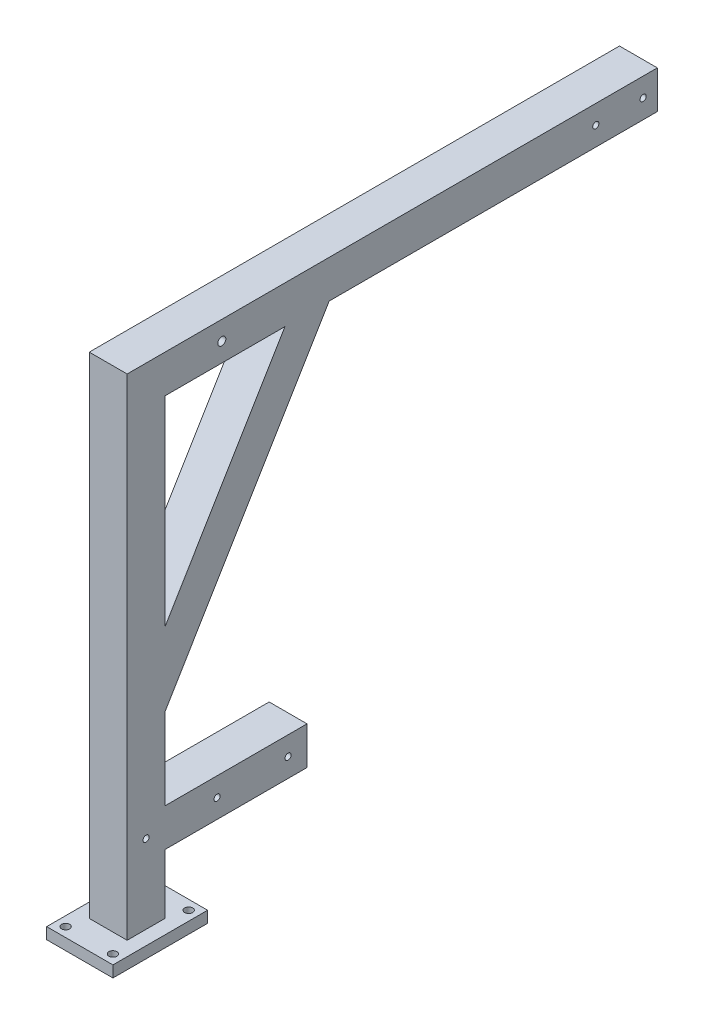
from build123d import *

# Parameters (mm, degrees)
EXTRUDE_1_DEPTH      = 590
SKETCH_4_OUTSIDE_W   = 231.236
SKETCH_4_OUTSIDE_H   = 751.236
SKETCH_4_OUTSIDE_R   = 4.25
CUT_EXTRUDE_1_DEPTH  = 797.178371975
SKETCH_5_OUTSIDE_W   = 751.236
SKETCH_5_OUTSIDE_H   = 691.236
SKETCH_5_OUTSIDE_R   = 3.25
SKETCH_5_OUTSIDE_R_2 = 4.25
CUT_EXTRUDE_2_DEPTH  = 590


with BuildPart() as part:
    # Sketch 2 → Extrude 1 (new body)
    with BuildSketch(Plane.XY):
        Polygon((55, 12), (55, 490), (55, 530), (15, 530), (15, 490), (15, 12), (0, 12), (0, 0), (70, 0), (70, 12), align=None)
    extrude(amount=EXTRUDE_1_DEPTH)

    # Sketch 4 outside → Cut-Extrude 1 (cut, through all)
    # profile 1 of 5: a face of its own
    with BuildSketch(Plane(origin=(0, 530, 0), x_dir=(1, 0, 0), z_dir=(0, 1, 0))):
        with Locations((35, -295)):
            Rectangle(SKETCH_4_OUTSIDE_W, SKETCH_4_OUTSIDE_H)
        Polygon((70, -490), (70, -590), (0, -590), (0, -490), (15, -490), (15, 0), (55, 0), (55, -490), align=None, mode=Mode.SUBTRACT)
    # profile 2 of 5: a face of its own
    with BuildSketch(Plane(origin=(0, 530, 0), x_dir=(1, 0, 0), z_dir=(0, 1, 0))):
        with Locations(Location((10, -580, 0), (0, 0, 270))):
            Circle(SKETCH_4_OUTSIDE_R)
    # profile 3 of 5: a face of its own
    with BuildSketch(Plane(origin=(0, 530, 0), x_dir=(1, 0, 0), z_dir=(0, 1, 0))):
        with Locations(Location((60, -580, 0), (0, 0, 270))):
            Circle(SKETCH_4_OUTSIDE_R)
    # profile 4 of 5: a face of its own
    with BuildSketch(Plane(origin=(0, 530, 0), x_dir=(1, 0, 0), z_dir=(0, 1, 0))):
        with Locations(Location((60, -500, 0), (0, 0, 270))):
            Circle(SKETCH_4_OUTSIDE_R)
    # profile 5 of 5: a face of its own
    with BuildSketch(Plane(origin=(0, 530, 0), x_dir=(1, 0, 0), z_dir=(0, 1, 0))):
        with Locations(Location((10, -500, 0), (0, 0, 270))):
            Circle(SKETCH_4_OUTSIDE_R)
    extrude(amount=-CUT_EXTRUDE_1_DEPTH, mode=Mode.SUBTRACT)

    # Sketch 5 outside → Cut-Extrude 2 (cut)
    # profile 1 of 8: a face of its own
    with BuildSketch(Plane(origin=(70, 0, 0), x_dir=(0, 0, -1), z_dir=(1, 0, 0))):
        with Locations((-295, 265)):
            Rectangle(SKETCH_5_OUTSIDE_W, SKETCH_5_OUTSIDE_H)
        Polygon((-560, 12), (-560, 490), (-560, 530), (0, 530), (0, 490), (-346.676192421, 490), (-520, 201.126987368), (-520, 115), (-370, 115), (-370, 75), (-520, 75), (-520, 12), (-490, 12), (-490, 0), (-590, 0), (-590, 12), align=None, mode=Mode.SUBTRACT)
    # profile 2 of 8: a face of its own
    with BuildSketch(Plane(origin=(70, 0, 0), x_dir=(0, 0, -1), z_dir=(1, 0, 0))):
        with Locations((-390, 95)):
            Circle(SKETCH_5_OUTSIDE_R)
    # profile 3 of 8: a face of its own
    with BuildSketch(Plane(origin=(70, 0, 0), x_dir=(0, 0, -1), z_dir=(1, 0, 0))):
        with Locations((-465, 95)):
            Circle(SKETCH_5_OUTSIDE_R)
    # profile 4 of 8: a face of its own
    with BuildSketch(Plane(origin=(70, 0, 0), x_dir=(0, 0, -1), z_dir=(1, 0, 0))):
        with Locations((-540, 95)):
            Circle(SKETCH_5_OUTSIDE_R)
    # profile 5 of 8: a face of its own
    with BuildSketch(Plane(origin=(70, 0, 0), x_dir=(0, 0, -1), z_dir=(1, 0, 0))):
        with Locations((-460, 510)):
            Circle(SKETCH_5_OUTSIDE_R_2)
    # profile 6 of 8: a face of its own
    with BuildSketch(Plane(origin=(70, 0, 0), x_dir=(0, 0, -1), z_dir=(1, 0, 0))):
        with Locations((-15, 510)):
            Circle(SKETCH_5_OUTSIDE_R)
    # profile 7 of 8: a face of its own
    with BuildSketch(Plane(origin=(70, 0, 0), x_dir=(0, 0, -1), z_dir=(1, 0, 0))):
        with Locations((-65, 510)):
            Circle(SKETCH_5_OUTSIDE_R)
    # profile 8 of 8: a face of its own
    with BuildSketch(Plane(origin=(70, 0, 0), x_dir=(0, 0, -1), z_dir=(1, 0, 0))):
        Polygon((-393.323807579, 490), (-520, 278.873012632), (-520, 490), align=None)
    extrude(amount=-CUT_EXTRUDE_2_DEPTH, mode=Mode.SUBTRACT)


solid = part.part
